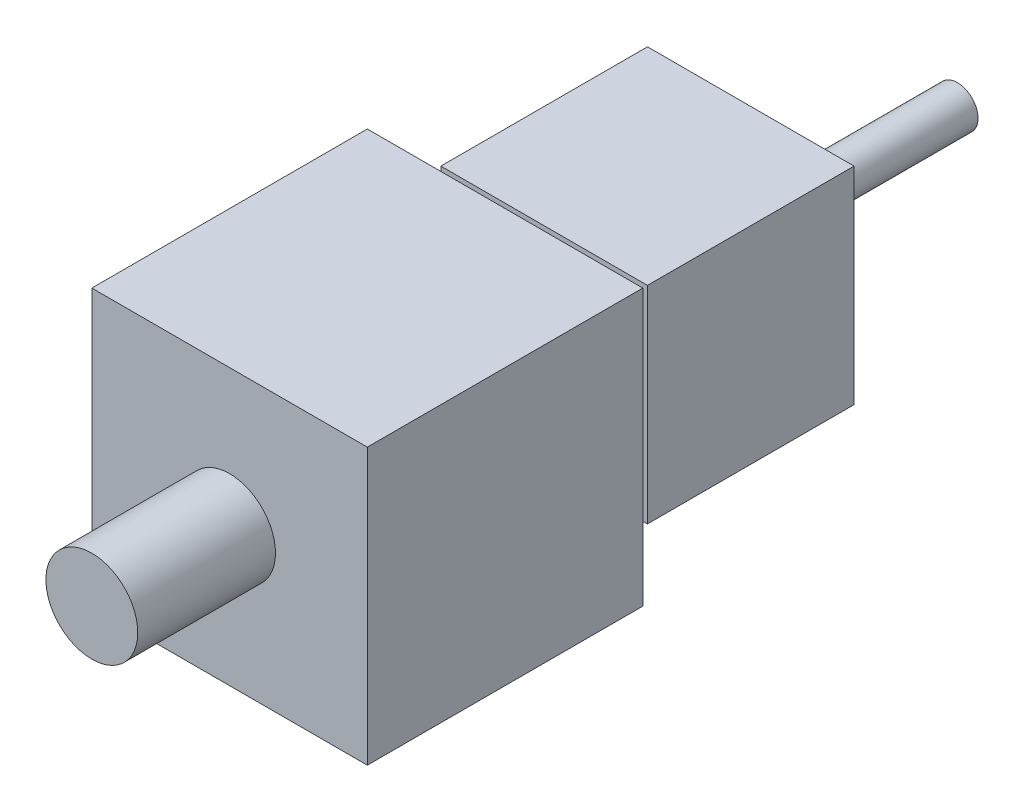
from build123d import *

# Parameters (mm, degrees)
SKIZZE1_W                       = 20
SKIZZE1_H                       = 20
AUFSATZ_LINEAR_AUSTRAGEN1_DEPTH = 20
SKIZZE2_R                       = 3.333333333
AUFSATZ_LINEAR_AUSTRAGEN2_DEPTH = 10
SKIZZE5_W                       = 15
SKIZZE5_H                       = 15
AUFSATZ_LINEAR_AUSTRAGEN3_DEPTH = 15
SKIZZE6_R                       = 1.5
AUFSATZ_LINEAR_AUSTRAGEN4_DEPTH = 15


with BuildPart() as part:
    # Skizze1 → Aufsatz-Linear austragen1 (new body)
    with BuildSketch(Plane.XY):
        with Locations((10, 10)):
            Rectangle(SKIZZE1_W, SKIZZE1_H)
    extrude(amount=AUFSATZ_LINEAR_AUSTRAGEN1_DEPTH)


with BuildPart() as body_2:
    # Skizze2 → Aufsatz-Linear austragen2 (new body)
    with BuildSketch(Plane.XY.offset(20)):
        with Locations((10, 10)):
            Circle(SKIZZE2_R)
    extrude(amount=AUFSATZ_LINEAR_AUSTRAGEN2_DEPTH)


with BuildPart() as body_3:
    # Skizze5 → Aufsatz-Linear austragen3 (new body)
    with BuildSketch(Plane.XY.offset(-5.337361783)):
        with Locations((7.5, 7.5)):
            Rectangle(SKIZZE5_W, SKIZZE5_H)
    extrude(amount=-AUFSATZ_LINEAR_AUSTRAGEN3_DEPTH)


with BuildPart() as body_4:
    # Skizze6 → Aufsatz-Linear austragen4 (new body)
    with BuildSketch(Plane(origin=(0, 0, -20.337361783), x_dir=(-1, 0, 0), z_dir=(0, 0, -1))):
        with Locations((-7.5, 7.5)):
            Circle(SKIZZE6_R)
    extrude(amount=AUFSATZ_LINEAR_AUSTRAGEN4_DEPTH)


solid = Compound([part.part, body_2.part, body_3.part, body_4.part])
